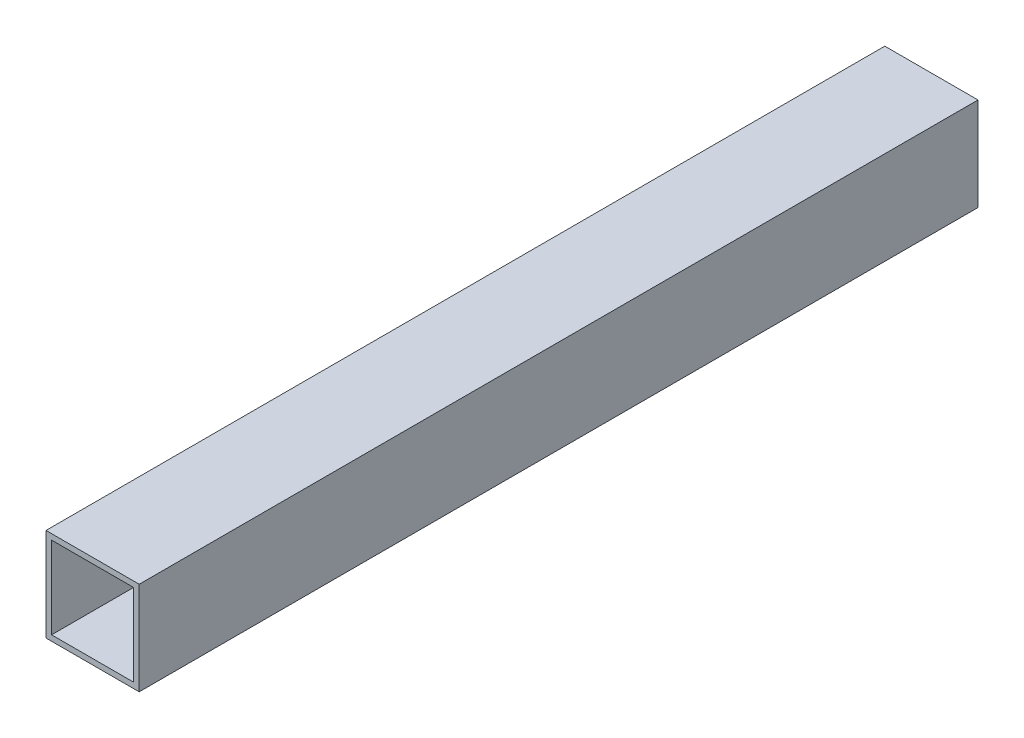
ISO-10303-21;
HEADER;
FILE_DESCRIPTION(('STEP AP214'),'2;1');
FILE_NAME('part.step','',(''),(''),'','','');
FILE_SCHEMA(('AUTOMOTIVE_DESIGN { 1 0 10303 214 1 1 1 1 }'));
ENDSEC;
DATA;
#1=APPLICATION_CONTEXT('core data for automotive mechanical design processes');
#2=APPLICATION_PROTOCOL_DEFINITION('international standard','automotive_design',2000,#1);
#3=PRODUCT_CONTEXT('',#1,'mechanical');
#4=PRODUCT('Part','Part','',(#3));
#5=PRODUCT_RELATED_PRODUCT_CATEGORY('part','',(#4));
#6=PRODUCT_DEFINITION_FORMATION('','',#4);
#7=PRODUCT_DEFINITION_CONTEXT('part definition',#1,'design');
#8=PRODUCT_DEFINITION('design','',#6,#7);
#9=PRODUCT_DEFINITION_SHAPE('','',#8);
#10=(LENGTH_UNIT() NAMED_UNIT(*) SI_UNIT(.MILLI.,.METRE.));
#11=(NAMED_UNIT(*) PLANE_ANGLE_UNIT() SI_UNIT($,.RADIAN.));
#12=(NAMED_UNIT(*) SI_UNIT($,.STERADIAN.) SOLID_ANGLE_UNIT());
#13=UNCERTAINTY_MEASURE_WITH_UNIT(LENGTH_MEASURE(1.E-05),#10,'distance_accuracy_value','');
#14=(GEOMETRIC_REPRESENTATION_CONTEXT(3) GLOBAL_UNCERTAINTY_ASSIGNED_CONTEXT((#13)) GLOBAL_UNIT_ASSIGNED_CONTEXT((#10,
#11,#12)) REPRESENTATION_CONTEXT('',''));
#15=CARTESIAN_POINT('',(0.,0.,0.));
#16=DIRECTION('',(0.,0.,1.));
#17=DIRECTION('',(1.,0.,0.));
#18=AXIS2_PLACEMENT_3D('',#15,#16,#17);
#19=CARTESIAN_POINT('',(0.,0.,450.));
#20=DIRECTION('',(0.,0.,1.));
#21=DIRECTION('',(1.,0.,0.));
#22=AXIS2_PLACEMENT_3D('',#19,#20,#21);
#23=PLANE('',#22);
#24=DIRECTION('',(0.,-1.,0.));
#25=VECTOR('',#24,1.);
#26=CARTESIAN_POINT('',(-50.,49.9999999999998,450.));
#27=LINE('',#26,#25);
#28=CARTESIAN_POINT('',(-50.,49.9999999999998,450.));
#29=VERTEX_POINT('',#28);
#30=CARTESIAN_POINT('',(-50.,-50.0000000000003,450.));
#31=VERTEX_POINT('',#30);
#32=EDGE_CURVE('E142',#29,#31,#27,.T.);
#33=ORIENTED_EDGE('',*,*,#32,.T.);
#34=DIRECTION('',(1.,0.,0.));
#35=VECTOR('',#34,1.);
#36=CARTESIAN_POINT('',(-50.,-50.0000000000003,450.));
#37=LINE('',#36,#35);
#38=CARTESIAN_POINT('',(50.0000000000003,-50.,450.));
#39=VERTEX_POINT('',#38);
#40=EDGE_CURVE('E145',#31,#39,#37,.T.);
#41=ORIENTED_EDGE('',*,*,#40,.T.);
#42=DIRECTION('',(0.,1.,0.));
#43=VECTOR('',#42,1.);
#44=CARTESIAN_POINT('',(50.0000000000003,50.,450.));
#45=LINE('',#44,#43);
#46=CARTESIAN_POINT('',(50.0000000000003,50.,450.));
#47=VERTEX_POINT('',#46);
#48=EDGE_CURVE('E148',#39,#47,#45,.T.);
#49=ORIENTED_EDGE('',*,*,#48,.T.);
#50=DIRECTION('',(-1.,0.,0.));
#51=VECTOR('',#50,1.);
#52=CARTESIAN_POINT('',(-50.,49.9999999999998,450.));
#53=LINE('',#52,#51);
#54=EDGE_CURVE('E150',#47,#29,#53,.T.);
#55=ORIENTED_EDGE('',*,*,#54,.T.);
#56=EDGE_LOOP('',(#33,#41,#49,#55));
#57=FACE_BOUND('',#56,.T.);
#58=DIRECTION('',(0.,-1.,0.));
#59=VECTOR('',#58,1.);
#60=CARTESIAN_POINT('',(-44.,44.,450.));
#61=LINE('',#60,#59);
#62=CARTESIAN_POINT('',(-44.,44.,450.));
#63=VERTEX_POINT('',#62);
#64=CARTESIAN_POINT('',(-44.,-44.,450.));
#65=VERTEX_POINT('',#64);
#66=EDGE_CURVE('E114',#63,#65,#61,.T.);
#67=ORIENTED_EDGE('',*,*,#66,.F.);
#68=DIRECTION('',(-1.,0.,0.));
#69=VECTOR('',#68,1.);
#70=CARTESIAN_POINT('',(-44.,44.,450.));
#71=LINE('',#70,#69);
#72=CARTESIAN_POINT('',(44.,44.,450.));
#73=VERTEX_POINT('',#72);
#74=EDGE_CURVE('E106',#73,#63,#71,.T.);
#75=ORIENTED_EDGE('',*,*,#74,.F.);
#76=DIRECTION('',(0.,1.,0.));
#77=VECTOR('',#76,1.);
#78=CARTESIAN_POINT('',(44.,44.,450.));
#79=LINE('',#78,#77);
#80=CARTESIAN_POINT('',(44.,-44.,450.));
#81=VERTEX_POINT('',#80);
#82=EDGE_CURVE('E128',#81,#73,#79,.T.);
#83=ORIENTED_EDGE('',*,*,#82,.F.);
#84=DIRECTION('',(1.,0.,0.));
#85=VECTOR('',#84,1.);
#86=CARTESIAN_POINT('',(-44.,-44.,450.));
#87=LINE('',#86,#85);
#88=EDGE_CURVE('E126',#65,#81,#87,.T.);
#89=ORIENTED_EDGE('',*,*,#88,.F.);
#90=EDGE_LOOP('',(#67,#75,#83,#89));
#91=FACE_BOUND('',#90,.T.);
#92=ADVANCED_FACE('F41',(#57,#91),#23,.T.);
#93=CARTESIAN_POINT('',(0.,0.,-450.));
#94=DIRECTION('',(0.,0.,1.));
#95=DIRECTION('',(1.,0.,0.));
#96=AXIS2_PLACEMENT_3D('',#93,#94,#95);
#97=PLANE('',#96);
#98=DIRECTION('',(0.,-1.,0.));
#99=VECTOR('',#98,1.);
#100=CARTESIAN_POINT('',(-50.,49.9999999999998,-450.));
#101=LINE('',#100,#99);
#102=CARTESIAN_POINT('',(-50.,49.9999999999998,-450.));
#103=VERTEX_POINT('',#102);
#104=CARTESIAN_POINT('',(-50.,-50.0000000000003,-450.));
#105=VERTEX_POINT('',#104);
#106=EDGE_CURVE('E122',#103,#105,#101,.T.);
#107=ORIENTED_EDGE('',*,*,#106,.F.);
#108=DIRECTION('',(-1.,0.,0.));
#109=VECTOR('',#108,1.);
#110=CARTESIAN_POINT('',(-50.,49.9999999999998,-450.));
#111=LINE('',#110,#109);
#112=CARTESIAN_POINT('',(50.0000000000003,50.,-450.));
#113=VERTEX_POINT('',#112);
#114=EDGE_CURVE('E146',#113,#103,#111,.T.);
#115=ORIENTED_EDGE('',*,*,#114,.F.);
#116=DIRECTION('',(0.,1.,0.));
#117=VECTOR('',#116,1.);
#118=CARTESIAN_POINT('',(50.0000000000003,50.,-450.));
#119=LINE('',#118,#117);
#120=CARTESIAN_POINT('',(50.0000000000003,-50.,-450.));
#121=VERTEX_POINT('',#120);
#122=EDGE_CURVE('E157',#121,#113,#119,.T.);
#123=ORIENTED_EDGE('',*,*,#122,.F.);
#124=DIRECTION('',(1.,0.,0.));
#125=VECTOR('',#124,1.);
#126=CARTESIAN_POINT('',(-50.,-50.0000000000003,-450.));
#127=LINE('',#126,#125);
#128=EDGE_CURVE('E155',#105,#121,#127,.T.);
#129=ORIENTED_EDGE('',*,*,#128,.F.);
#130=EDGE_LOOP('',(#107,#115,#123,#129));
#131=FACE_BOUND('',#130,.T.);
#132=DIRECTION('',(-1.,0.,0.));
#133=VECTOR('',#132,1.);
#134=CARTESIAN_POINT('',(-44.,44.,-450.));
#135=LINE('',#134,#133);
#136=CARTESIAN_POINT('',(44.,44.,-450.));
#137=VERTEX_POINT('',#136);
#138=CARTESIAN_POINT('',(-44.,44.,-450.));
#139=VERTEX_POINT('',#138);
#140=EDGE_CURVE('E64',#137,#139,#135,.T.);
#141=ORIENTED_EDGE('',*,*,#140,.T.);
#142=DIRECTION('',(0.,-1.,0.));
#143=VECTOR('',#142,1.);
#144=CARTESIAN_POINT('',(-44.,44.,-450.));
#145=LINE('',#144,#143);
#146=CARTESIAN_POINT('',(-44.,-44.,-450.));
#147=VERTEX_POINT('',#146);
#148=EDGE_CURVE('E121',#139,#147,#145,.T.);
#149=ORIENTED_EDGE('',*,*,#148,.T.);
#150=DIRECTION('',(1.,0.,0.));
#151=VECTOR('',#150,1.);
#152=CARTESIAN_POINT('',(-44.,-44.,-450.));
#153=LINE('',#152,#151);
#154=CARTESIAN_POINT('',(44.,-44.,-450.));
#155=VERTEX_POINT('',#154);
#156=EDGE_CURVE('E134',#147,#155,#153,.T.);
#157=ORIENTED_EDGE('',*,*,#156,.T.);
#158=DIRECTION('',(0.,1.,0.));
#159=VECTOR('',#158,1.);
#160=CARTESIAN_POINT('',(44.,44.,-450.));
#161=LINE('',#160,#159);
#162=EDGE_CURVE('E115',#155,#137,#161,.T.);
#163=ORIENTED_EDGE('',*,*,#162,.T.);
#164=EDGE_LOOP('',(#141,#149,#157,#163));
#165=FACE_BOUND('',#164,.T.);
#166=ADVANCED_FACE('F175',(#131,#165),#97,.F.);
#167=CARTESIAN_POINT('',(-50.,49.9999999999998,450.));
#168=DIRECTION('',(1.,0.,0.));
#169=DIRECTION('',(0.,0.,-1.));
#170=AXIS2_PLACEMENT_3D('',#167,#168,#169);
#171=PLANE('',#170);
#172=ORIENTED_EDGE('',*,*,#106,.T.);
#173=DIRECTION('',(0.,0.,-1.));
#174=VECTOR('',#173,1.);
#175=CARTESIAN_POINT('',(-50.,-50.0000000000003,450.));
#176=LINE('',#175,#174);
#177=EDGE_CURVE('E11',#31,#105,#176,.T.);
#178=ORIENTED_EDGE('',*,*,#177,.F.);
#179=ORIENTED_EDGE('',*,*,#32,.F.);
#180=DIRECTION('',(0.,0.,-1.));
#181=VECTOR('',#180,1.);
#182=CARTESIAN_POINT('',(-50.,49.9999999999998,450.));
#183=LINE('',#182,#181);
#184=EDGE_CURVE('E152',#29,#103,#183,.T.);
#185=ORIENTED_EDGE('',*,*,#184,.T.);
#186=EDGE_LOOP('',(#172,#178,#179,#185));
#187=FACE_BOUND('',#186,.T.);
#188=ADVANCED_FACE('F43',(#187),#171,.F.);
#189=CARTESIAN_POINT('',(-50.,-50.0000000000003,450.));
#190=DIRECTION('',(0.,1.,0.));
#191=DIRECTION('',(-1.,0.,0.));
#192=AXIS2_PLACEMENT_3D('',#189,#190,#191);
#193=PLANE('',#192);
#194=ORIENTED_EDGE('',*,*,#128,.T.);
#195=DIRECTION('',(0.,0.,-1.));
#196=VECTOR('',#195,1.);
#197=CARTESIAN_POINT('',(50.0000000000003,-50.,450.));
#198=LINE('',#197,#196);
#199=EDGE_CURVE('E49',#39,#121,#198,.T.);
#200=ORIENTED_EDGE('',*,*,#199,.F.);
#201=ORIENTED_EDGE('',*,*,#40,.F.);
#202=ORIENTED_EDGE('',*,*,#177,.T.);
#203=EDGE_LOOP('',(#194,#200,#201,#202));
#204=FACE_BOUND('',#203,.T.);
#205=ADVANCED_FACE('F185',(#204),#193,.F.);
#206=CARTESIAN_POINT('',(50.0000000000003,50.,450.));
#207=DIRECTION('',(-1.,0.,0.));
#208=DIRECTION('',(0.,0.,1.));
#209=AXIS2_PLACEMENT_3D('',#206,#207,#208);
#210=PLANE('',#209);
#211=ORIENTED_EDGE('',*,*,#122,.T.);
#212=DIRECTION('',(0.,0.,-1.));
#213=VECTOR('',#212,1.);
#214=CARTESIAN_POINT('',(50.0000000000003,50.,450.));
#215=LINE('',#214,#213);
#216=EDGE_CURVE('E162',#47,#113,#215,.T.);
#217=ORIENTED_EDGE('',*,*,#216,.F.);
#218=ORIENTED_EDGE('',*,*,#48,.F.);
#219=ORIENTED_EDGE('',*,*,#199,.T.);
#220=EDGE_LOOP('',(#211,#217,#218,#219));
#221=FACE_BOUND('',#220,.T.);
#222=ADVANCED_FACE('F169',(#221),#210,.F.);
#223=CARTESIAN_POINT('',(-50.,49.9999999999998,450.));
#224=DIRECTION('',(0.,-1.,0.));
#225=DIRECTION('',(1.,0.,0.));
#226=AXIS2_PLACEMENT_3D('',#223,#224,#225);
#227=PLANE('',#226);
#228=ORIENTED_EDGE('',*,*,#114,.T.);
#229=ORIENTED_EDGE('',*,*,#184,.F.);
#230=ORIENTED_EDGE('',*,*,#54,.F.);
#231=ORIENTED_EDGE('',*,*,#216,.T.);
#232=EDGE_LOOP('',(#228,#229,#230,#231));
#233=FACE_BOUND('',#232,.T.);
#234=ADVANCED_FACE('F179',(#233),#227,.F.);
#235=CARTESIAN_POINT('',(-44.,44.,450.));
#236=DIRECTION('',(0.,-1.,0.));
#237=DIRECTION('',(1.,0.,0.));
#238=AXIS2_PLACEMENT_3D('',#235,#236,#237);
#239=PLANE('',#238);
#240=ORIENTED_EDGE('',*,*,#140,.F.);
#241=DIRECTION('',(0.,0.,-1.));
#242=VECTOR('',#241,1.);
#243=CARTESIAN_POINT('',(44.,44.,450.));
#244=LINE('',#243,#242);
#245=EDGE_CURVE('E110',#73,#137,#244,.T.);
#246=ORIENTED_EDGE('',*,*,#245,.F.);
#247=ORIENTED_EDGE('',*,*,#74,.T.);
#248=DIRECTION('',(0.,0.,-1.));
#249=VECTOR('',#248,1.);
#250=CARTESIAN_POINT('',(-44.,44.,450.));
#251=LINE('',#250,#249);
#252=EDGE_CURVE('E109',#63,#139,#251,.T.);
#253=ORIENTED_EDGE('',*,*,#252,.T.);
#254=EDGE_LOOP('',(#240,#246,#247,#253));
#255=FACE_BOUND('',#254,.T.);
#256=ADVANCED_FACE('F108',(#255),#239,.T.);
#257=CARTESIAN_POINT('',(-44.,44.,450.));
#258=DIRECTION('',(1.,0.,0.));
#259=DIRECTION('',(0.,1.,0.));
#260=AXIS2_PLACEMENT_3D('',#257,#258,#259);
#261=PLANE('',#260);
#262=ORIENTED_EDGE('',*,*,#148,.F.);
#263=ORIENTED_EDGE('',*,*,#252,.F.);
#264=ORIENTED_EDGE('',*,*,#66,.T.);
#265=DIRECTION('',(0.,0.,-1.));
#266=VECTOR('',#265,1.);
#267=CARTESIAN_POINT('',(-44.,-44.,450.));
#268=LINE('',#267,#266);
#269=EDGE_CURVE('E123',#65,#147,#268,.T.);
#270=ORIENTED_EDGE('',*,*,#269,.T.);
#271=EDGE_LOOP('',(#262,#263,#264,#270));
#272=FACE_BOUND('',#271,.T.);
#273=ADVANCED_FACE('F118',(#272),#261,.T.);
#274=CARTESIAN_POINT('',(-44.,-44.,450.));
#275=DIRECTION('',(0.,1.,0.));
#276=DIRECTION('',(0.,0.,1.));
#277=AXIS2_PLACEMENT_3D('',#274,#275,#276);
#278=PLANE('',#277);
#279=ORIENTED_EDGE('',*,*,#156,.F.);
#280=ORIENTED_EDGE('',*,*,#269,.F.);
#281=ORIENTED_EDGE('',*,*,#88,.T.);
#282=DIRECTION('',(0.,0.,-1.));
#283=VECTOR('',#282,1.);
#284=CARTESIAN_POINT('',(44.,-44.,450.));
#285=LINE('',#284,#283);
#286=EDGE_CURVE('E56',#81,#155,#285,.T.);
#287=ORIENTED_EDGE('',*,*,#286,.T.);
#288=EDGE_LOOP('',(#279,#280,#281,#287));
#289=FACE_BOUND('',#288,.T.);
#290=ADVANCED_FACE('F208',(#289),#278,.T.);
#291=CARTESIAN_POINT('',(44.,44.,450.));
#292=DIRECTION('',(-1.,0.,0.));
#293=DIRECTION('',(0.,-1.,0.));
#294=AXIS2_PLACEMENT_3D('',#291,#292,#293);
#295=PLANE('',#294);
#296=ORIENTED_EDGE('',*,*,#162,.F.);
#297=ORIENTED_EDGE('',*,*,#286,.F.);
#298=ORIENTED_EDGE('',*,*,#82,.T.);
#299=ORIENTED_EDGE('',*,*,#245,.T.);
#300=EDGE_LOOP('',(#296,#297,#298,#299));
#301=FACE_BOUND('',#300,.T.);
#302=ADVANCED_FACE('F212',(#301),#295,.T.);
#303=CLOSED_SHELL('',(#92,#166,#188,#205,#222,#234,#256,#273,#290,#302));
#304=MANIFOLD_SOLID_BREP('B2',#303);
#305=ADVANCED_BREP_SHAPE_REPRESENTATION('',(#18,#304),#14);
#306=SHAPE_DEFINITION_REPRESENTATION(#9,#305);
ENDSEC;
END-ISO-10303-21;
